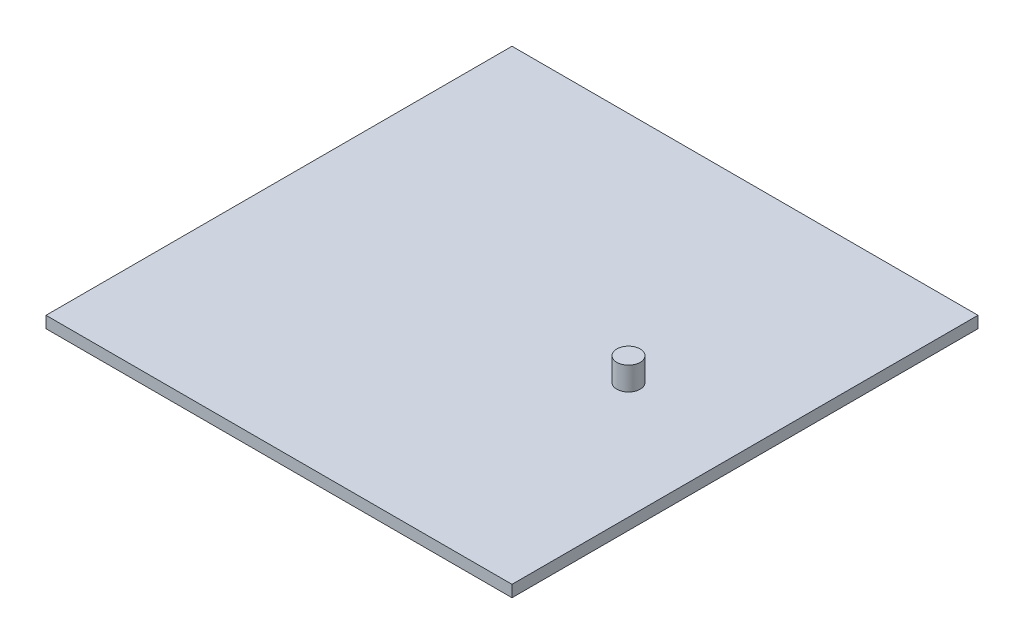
from build123d import *

# Parameters (mm, degrees)
SKETCH1_W           = 200
SKETCH1_H           = 200
BOSS_EXTRUDE1_DEPTH = 5
SKETCH2_R           = 5
BOSS_EXTRUDE2_DEPTH = 10


with BuildPart() as part:
    # Sketch1 → Boss-Extrude1 (new body)
    with BuildSketch(Plane(origin=(0, 0, 0), x_dir=(1, 0, 0), z_dir=(0, 1, 0))):
        with Locations((100, 100)):
            Rectangle(SKETCH1_W, SKETCH1_H)
    extrude(amount=BOSS_EXTRUDE1_DEPTH)

    # Sketch2 → Boss-Extrude2 (add)
    with BuildSketch(Plane(origin=(0, 5, 0), x_dir=(1, 0, 0), z_dir=(0, 1, 0))):
        with Locations(Location((150, 100, 0), (0, 0, 90))):
            Circle(SKETCH2_R)
    extrude(amount=BOSS_EXTRUDE2_DEPTH)


solid = part.part
